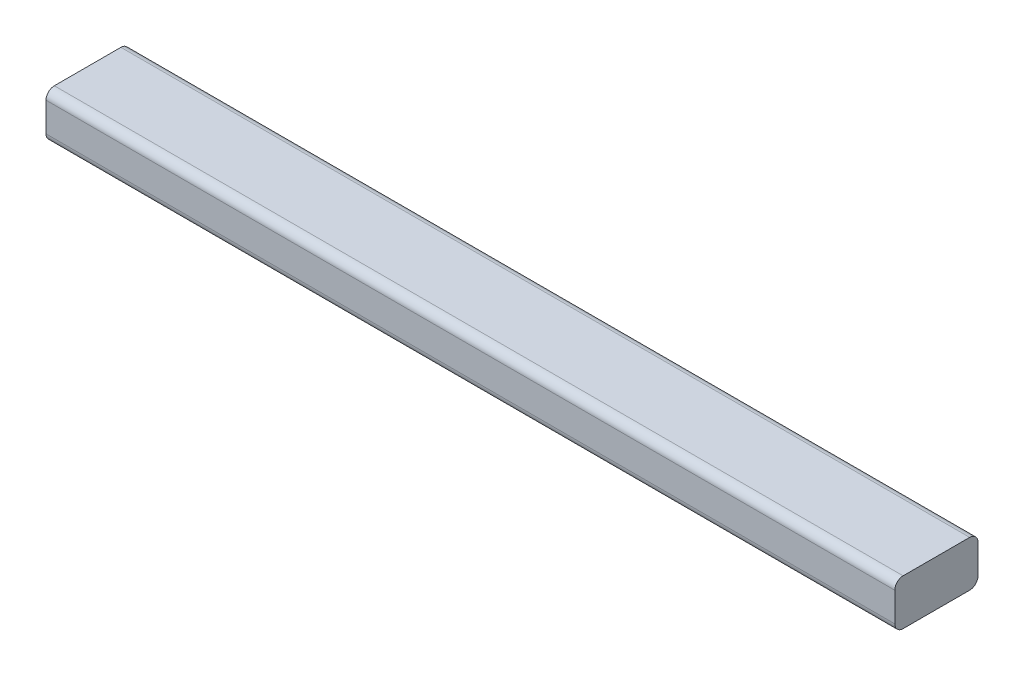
from build123d import *

# Parameters (mm, degrees)
SKETCH2_W           = 63.5
SKETCH2_H           = 34.925
BOSS_EXTRUDE1_DEPTH = 647.7
FILLET1_R           = 6.35


with BuildPart() as part:
    # Sketch2 → Boss-Extrude1 (new body)
    with BuildSketch(Plane(origin=(0, 0, 0), x_dir=(0, 0, -1), z_dir=(1, 0, 0))):
        with Locations((-31.75, 17.4625)):
            Rectangle(SKETCH2_W, SKETCH2_H)
    extrude(amount=BOSS_EXTRUDE1_DEPTH)

    # Fillet1
    fillet1_edges = [part.edges().sort_by_distance(p)[0] for p in [
        (323.85, 34.925, 63.5),
        (323.85, 0, 63.5),
        (323.85, 0, 0),
        (323.85, 34.925, 0),
    ]]
    fillet(fillet1_edges, radius=FILLET1_R)


solid = part.part
